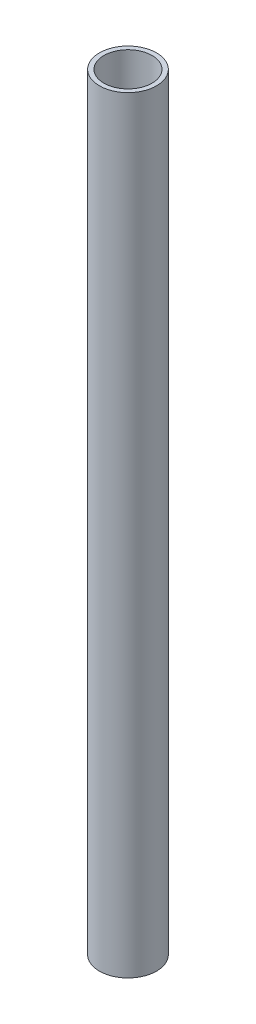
from build123d import *

# Parameters (mm, degrees)
SKETCH2_R           = 19
SKETCH2_R_2         = 16
EXTRUDE_THIN1_DEPTH = 255


with BuildPart() as part:
    # Sketch2 → Extrude-Thin1 (new, symmetric)
    with BuildSketch(Plane(origin=(0, 0, 0), x_dir=(1, 0, 0), z_dir=(0, 1, 0))):
        Circle(SKETCH2_R)
        Circle(SKETCH2_R_2, mode=Mode.SUBTRACT)
    extrude(amount=EXTRUDE_THIN1_DEPTH, both=True)


solid = part.part
